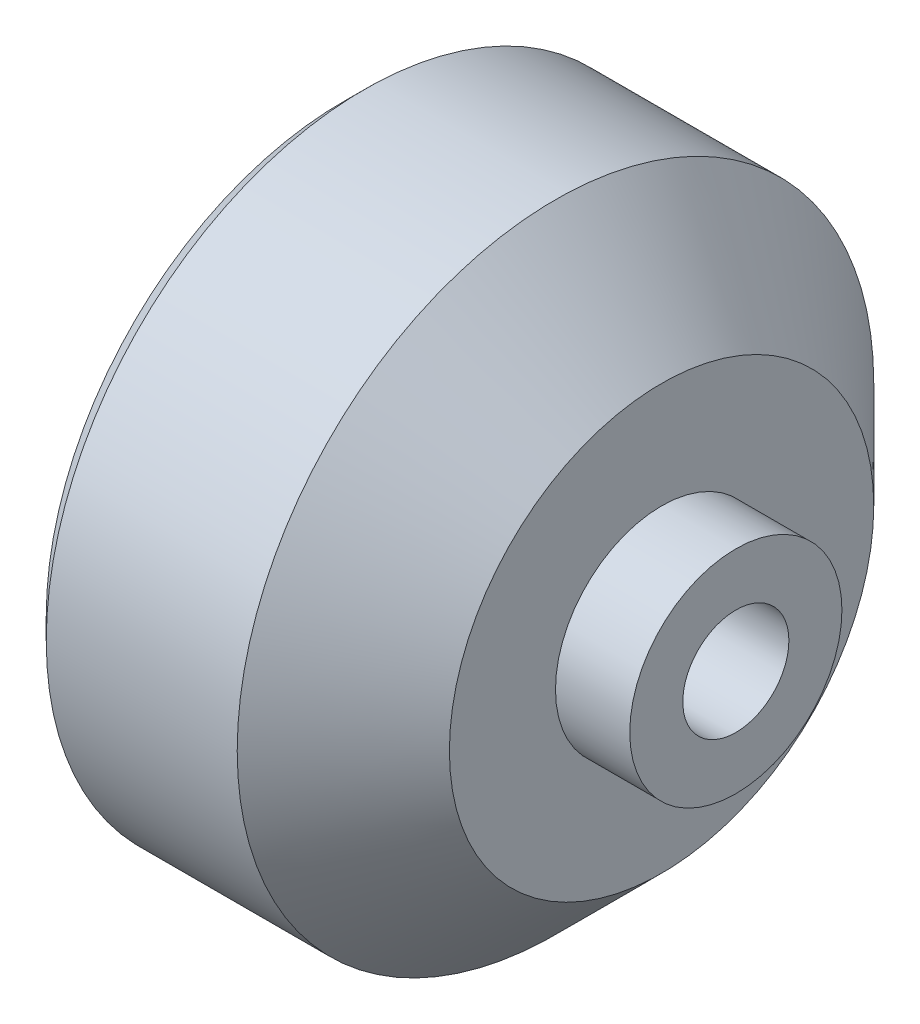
ISO-10303-21;
HEADER;
FILE_DESCRIPTION(('STEP AP214'),'2;1');
FILE_NAME('part.step','',(''),(''),'','','');
FILE_SCHEMA(('AUTOMOTIVE_DESIGN { 1 0 10303 214 1 1 1 1 }'));
ENDSEC;
DATA;
#1=APPLICATION_CONTEXT('core data for automotive mechanical design processes');
#2=APPLICATION_PROTOCOL_DEFINITION('international standard','automotive_design',2000,#1);
#3=PRODUCT_CONTEXT('',#1,'mechanical');
#4=PRODUCT('Part','Part','',(#3));
#5=PRODUCT_RELATED_PRODUCT_CATEGORY('part','',(#4));
#6=PRODUCT_DEFINITION_FORMATION('','',#4);
#7=PRODUCT_DEFINITION_CONTEXT('part definition',#1,'design');
#8=PRODUCT_DEFINITION('design','',#6,#7);
#9=PRODUCT_DEFINITION_SHAPE('','',#8);
#10=(LENGTH_UNIT() NAMED_UNIT(*) SI_UNIT(.MILLI.,.METRE.));
#11=(NAMED_UNIT(*) PLANE_ANGLE_UNIT() SI_UNIT($,.RADIAN.));
#12=(NAMED_UNIT(*) SI_UNIT($,.STERADIAN.) SOLID_ANGLE_UNIT());
#13=UNCERTAINTY_MEASURE_WITH_UNIT(LENGTH_MEASURE(1.E-05),#10,'distance_accuracy_value','');
#14=(GEOMETRIC_REPRESENTATION_CONTEXT(3) GLOBAL_UNCERTAINTY_ASSIGNED_CONTEXT((#13)) GLOBAL_UNIT_ASSIGNED_CONTEXT((#10,
#11,#12)) REPRESENTATION_CONTEXT('',''));
#15=CARTESIAN_POINT('',(0.,0.,0.));
#16=DIRECTION('',(0.,0.,1.));
#17=DIRECTION('',(1.,0.,0.));
#18=AXIS2_PLACEMENT_3D('',#15,#16,#17);
#19=CARTESIAN_POINT('',(0.,0.,-14.));
#20=DIRECTION('',(1.,0.,0.));
#21=DIRECTION('',(0.,0.,-1.));
#22=AXIS2_PLACEMENT_3D('',#19,#20,#21);
#23=PLANE('',#22);
#24=CARTESIAN_POINT('',(0.,0.,0.));
#25=DIRECTION('',(1.,0.,0.));
#26=DIRECTION('',(0.,0.,-1.));
#27=AXIS2_PLACEMENT_3D('',#24,#25,#26);
#28=CIRCLE('',#27,2.5);
#29=CARTESIAN_POINT('',(0.,0.,-2.5));
#30=VERTEX_POINT('',#29);
#31=EDGE_CURVE('E55',#30,#30,#28,.T.);
#32=ORIENTED_EDGE('',*,*,#31,.T.);
#33=EDGE_LOOP('',(#32));
#34=FACE_BOUND('',#33,.T.);
#35=CARTESIAN_POINT('',(0.,0.,0.));
#36=DIRECTION('',(-1.,0.,0.));
#37=DIRECTION('',(0.,0.,1.));
#38=AXIS2_PLACEMENT_3D('',#35,#36,#37);
#39=CIRCLE('',#38,14.);
#40=CARTESIAN_POINT('',(0.,0.,14.));
#41=VERTEX_POINT('',#40);
#42=EDGE_CURVE('E52',#41,#41,#39,.T.);
#43=ORIENTED_EDGE('',*,*,#42,.T.);
#44=EDGE_LOOP('',(#43));
#45=FACE_BOUND('',#44,.T.);
#46=ADVANCED_FACE('F30',(#34,#45),#23,.F.);
#47=CARTESIAN_POINT('',(18.5,0.,0.));
#48=DIRECTION('',(-1.,0.,0.));
#49=DIRECTION('',(0.,0.,1.));
#50=AXIS2_PLACEMENT_3D('',#47,#48,#49);
#51=PLANE('',#50);
#52=CARTESIAN_POINT('',(18.5,0.,0.));
#53=DIRECTION('',(1.,0.,0.));
#54=DIRECTION('',(0.,0.,-1.));
#55=AXIS2_PLACEMENT_3D('',#52,#53,#54);
#56=CIRCLE('',#55,2.5);
#57=CARTESIAN_POINT('',(18.5,0.,-2.5));
#58=VERTEX_POINT('',#57);
#59=EDGE_CURVE('E58',#58,#58,#56,.T.);
#60=ORIENTED_EDGE('',*,*,#59,.F.);
#61=EDGE_LOOP('',(#60));
#62=FACE_BOUND('',#61,.T.);
#63=CARTESIAN_POINT('',(18.5,0.,0.));
#64=DIRECTION('',(-1.,0.,0.));
#65=DIRECTION('',(0.,0.,1.));
#66=AXIS2_PLACEMENT_3D('',#63,#64,#65);
#67=CIRCLE('',#66,5.);
#68=CARTESIAN_POINT('',(18.5,0.,5.));
#69=VERTEX_POINT('',#68);
#70=EDGE_CURVE('E10',#69,#69,#67,.T.);
#71=ORIENTED_EDGE('',*,*,#70,.F.);
#72=EDGE_LOOP('',(#71));
#73=FACE_BOUND('',#72,.T.);
#74=ADVANCED_FACE('F64',(#62,#73),#51,.F.);
#75=CARTESIAN_POINT('',(0.,0.,0.));
#76=DIRECTION('',(-1.,0.,0.));
#77=DIRECTION('',(0.,0.,1.));
#78=AXIS2_PLACEMENT_3D('',#75,#76,#77);
#79=CYLINDRICAL_SURFACE('',#78,5.);
#80=CARTESIAN_POINT('',(15.,0.,0.));
#81=DIRECTION('',(-1.,0.,0.));
#82=DIRECTION('',(0.,0.,1.));
#83=AXIS2_PLACEMENT_3D('',#80,#81,#82);
#84=CIRCLE('',#83,5.);
#85=CARTESIAN_POINT('',(15.,0.,5.));
#86=VERTEX_POINT('',#85);
#87=EDGE_CURVE('E36',#86,#86,#84,.T.);
#88=ORIENTED_EDGE('',*,*,#87,.F.);
#89=EDGE_LOOP('',(#88));
#90=FACE_BOUND('',#89,.T.);
#91=ORIENTED_EDGE('',*,*,#70,.T.);
#92=EDGE_LOOP('',(#91));
#93=FACE_BOUND('',#92,.T.);
#94=ADVANCED_FACE('F67',(#90,#93),#79,.T.);
#95=CARTESIAN_POINT('',(15.,0.,-5.));
#96=DIRECTION('',(-1.,0.,0.));
#97=DIRECTION('',(0.,0.,1.));
#98=AXIS2_PLACEMENT_3D('',#95,#96,#97);
#99=PLANE('',#98);
#100=CARTESIAN_POINT('',(15.,0.,0.));
#101=DIRECTION('',(-1.,0.,0.));
#102=DIRECTION('',(0.,0.,1.));
#103=AXIS2_PLACEMENT_3D('',#100,#101,#102);
#104=CIRCLE('',#103,10.);
#105=CARTESIAN_POINT('',(15.,0.,10.));
#106=VERTEX_POINT('',#105);
#107=EDGE_CURVE('E40',#106,#106,#104,.T.);
#108=ORIENTED_EDGE('',*,*,#107,.F.);
#109=EDGE_LOOP('',(#108));
#110=FACE_BOUND('',#109,.T.);
#111=ORIENTED_EDGE('',*,*,#87,.T.);
#112=EDGE_LOOP('',(#111));
#113=FACE_BOUND('',#112,.T.);
#114=ADVANCED_FACE('F72',(#110,#113),#99,.F.);
#115=CARTESIAN_POINT('',(15.,0.,0.));
#116=DIRECTION('',(-1.,0.,0.));
#117=DIRECTION('',(0.,0.,1.));
#118=AXIS2_PLACEMENT_3D('',#115,#116,#117);
#119=CONICAL_SURFACE('',#118,10.,0.785398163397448);
#120=CARTESIAN_POINT('',(10.,0.,0.));
#121=DIRECTION('',(-1.,0.,0.));
#122=DIRECTION('',(0.,0.,1.));
#123=AXIS2_PLACEMENT_3D('',#120,#121,#122);
#124=CIRCLE('',#123,15.);
#125=CARTESIAN_POINT('',(10.,0.,15.));
#126=VERTEX_POINT('',#125);
#127=EDGE_CURVE('E44',#126,#126,#124,.T.);
#128=ORIENTED_EDGE('',*,*,#127,.F.);
#129=EDGE_LOOP('',(#128));
#130=FACE_BOUND('',#129,.T.);
#131=ORIENTED_EDGE('',*,*,#107,.T.);
#132=EDGE_LOOP('',(#131));
#133=FACE_BOUND('',#132,.T.);
#134=ADVANCED_FACE('F79',(#130,#133),#119,.T.);
#135=CARTESIAN_POINT('',(0.,0.,0.));
#136=DIRECTION('',(-1.,0.,0.));
#137=DIRECTION('',(0.,0.,1.));
#138=AXIS2_PLACEMENT_3D('',#135,#136,#137);
#139=CYLINDRICAL_SURFACE('',#138,15.);
#140=CARTESIAN_POINT('',(1.,0.,0.));
#141=DIRECTION('',(-1.,0.,0.));
#142=DIRECTION('',(0.,0.,1.));
#143=AXIS2_PLACEMENT_3D('',#140,#141,#142);
#144=CIRCLE('',#143,15.);
#145=CARTESIAN_POINT('',(1.,0.,15.));
#146=VERTEX_POINT('',#145);
#147=EDGE_CURVE('E49',#146,#146,#144,.T.);
#148=ORIENTED_EDGE('',*,*,#147,.F.);
#149=EDGE_LOOP('',(#148));
#150=FACE_BOUND('',#149,.T.);
#151=ORIENTED_EDGE('',*,*,#127,.T.);
#152=EDGE_LOOP('',(#151));
#153=FACE_BOUND('',#152,.T.);
#154=ADVANCED_FACE('F83',(#150,#153),#139,.T.);
#155=CARTESIAN_POINT('',(1.,0.,0.));
#156=DIRECTION('',(1.,0.,0.));
#157=DIRECTION('',(0.,0.,-1.));
#158=AXIS2_PLACEMENT_3D('',#155,#156,#157);
#159=CONICAL_SURFACE('',#158,15.,0.785398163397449);
#160=ORIENTED_EDGE('',*,*,#42,.F.);
#161=EDGE_LOOP('',(#160));
#162=FACE_BOUND('',#161,.T.);
#163=ORIENTED_EDGE('',*,*,#147,.T.);
#164=EDGE_LOOP('',(#163));
#165=FACE_BOUND('',#164,.T.);
#166=ADVANCED_FACE('F87',(#162,#165),#159,.T.);
#167=CARTESIAN_POINT('',(0.,0.,0.));
#168=DIRECTION('',(1.,0.,0.));
#169=DIRECTION('',(0.,0.,-1.));
#170=AXIS2_PLACEMENT_3D('',#167,#168,#169);
#171=CYLINDRICAL_SURFACE('',#170,2.5);
#172=ORIENTED_EDGE('',*,*,#31,.F.);
#173=EDGE_LOOP('',(#172));
#174=FACE_BOUND('',#173,.T.);
#175=ORIENTED_EDGE('',*,*,#59,.T.);
#176=EDGE_LOOP('',(#175));
#177=FACE_BOUND('',#176,.T.);
#178=ADVANCED_FACE('F62',(#174,#177),#171,.F.);
#179=CLOSED_SHELL('',(#46,#74,#94,#114,#134,#154,#166,#178));
#180=MANIFOLD_SOLID_BREP('B2',#179);
#181=ADVANCED_BREP_SHAPE_REPRESENTATION('',(#18,#180),#14);
#182=SHAPE_DEFINITION_REPRESENTATION(#9,#181);
ENDSEC;
END-ISO-10303-21;
